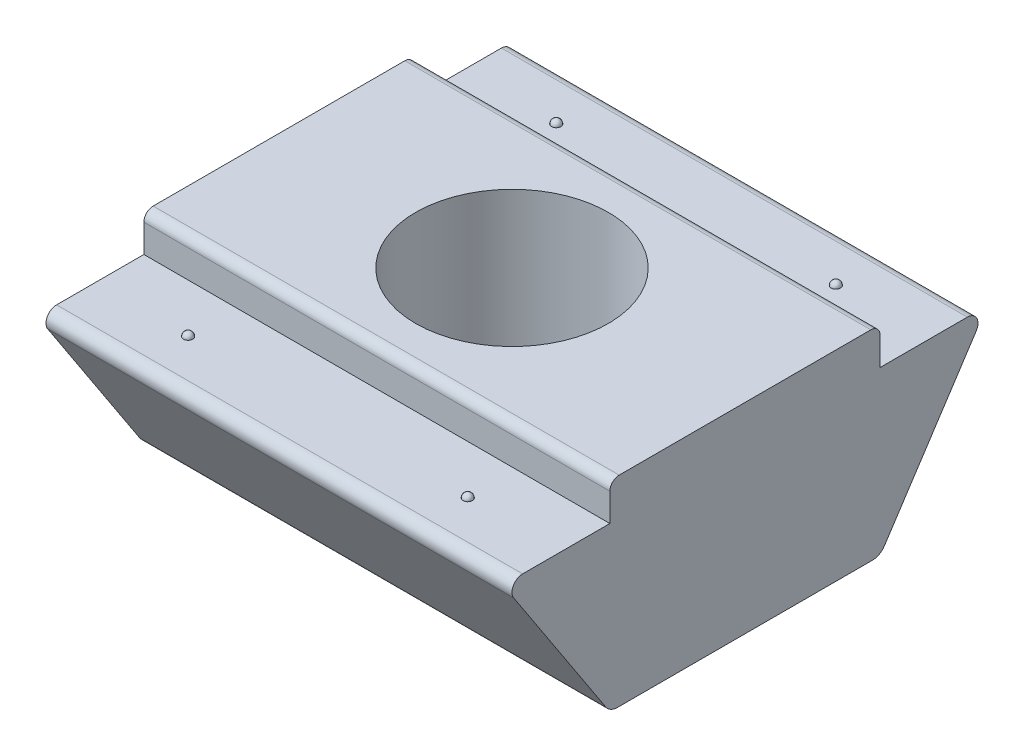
from build123d import *

# Parameters (mm, degrees)
BOSS_EXTRUDE1_DEPTH  = 5
FILLET1_R            = 0.2
FILLET2_R            = 0.3
LPATTERN1_COUNT      = 2
LPATTERN1_PITCH      = 7.9
LPATTERN1_COUNT_DIR2 = 2
LPATTERN1_PITCH_DIR2 = 6
TAP1_D               = 4.134


with BuildPart() as part:
    # Sketch1 → Boss-Extrude1 (new, symmetric)
    with BuildSketch(Plane(origin=(0, 0, 0), x_dir=(0, 0, -1), z_dir=(1, 0, 0))):
        with BuildLine():
            Line((2.9, -3.5), (-2.9, -3.5))
            Line((-2.9, -3.5), (-4.962689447, -0.352986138))
            ThreePointArc((-4.962689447, -0.352986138), (-4.972600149, -0.119632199), (-4.772, 0))
            Line((-4.772, 0), (-2.9, 0))
            Line((-2.9, 0), (-2.9, 0.8))
            Line((-2.9, 0.8), (2.9, 0.8))
            Line((2.9, 0.8), (2.9, 0))
            Line((2.9, 0), (4.772, 0))
            ThreePointArc((4.772, 0), (4.972600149, -0.119632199), (4.962689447, -0.352986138))
            Line((4.962689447, -0.352986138), (2.9, -3.5))
        make_face()
    extrude(amount=BOSS_EXTRUDE1_DEPTH, both=True)

    # Fillet1
    fillet1_edges = [part.edges().sort_by_distance(p)[0] for p in [
        (0, 0.8, 2.9),
        (0, 0.8, -2.9),
    ]]
    fillet(fillet1_edges, radius=FILLET1_R)

    # Fillet2
    fillet2_edges = [part.edges().sort_by_distance(p)[0] for p in [
        (0, -3.5, -2.9),
        (0, -3.5, 2.9),
    ]]
    fillet(fillet2_edges, radius=FILLET2_R)

    # Sketch2 → Revolve1 (revolve)
    with BuildSketch(Plane(origin=(-3, 0, 0.95), x_dir=(0, 0, -1), z_dir=(1, 0, 0))):
        with BuildLine():
            Line((-3, 0), (-3.1, 0))
            ThreePointArc((-3.1, 0), (-3.070710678, 0.070710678), (-3, 0.1))
            Line((-3, 0.1), (-3, 0))
        make_face()
    revolve1 = revolve(axis=Axis((-3, 0, 3.95), (0, 1, 0)))

    # LPattern1: Revolve1 2 × 2
    with Locations(*[(j * LPATTERN1_PITCH_DIR2, 0, -i * LPATTERN1_PITCH) for i in range(LPATTERN1_COUNT) for j in range(LPATTERN1_COUNT_DIR2) if (i, j) != (0, 0)]):
        add(revolve1)

    # Tap1 (through all)
    with Locations(Plane(origin=(0, 0.8, 0), x_dir=(1, 0, 0), z_dir=(0, 1, 0))):
        with Locations((0, 0)):
            Hole(TAP1_D / 2)


solid = part.part
